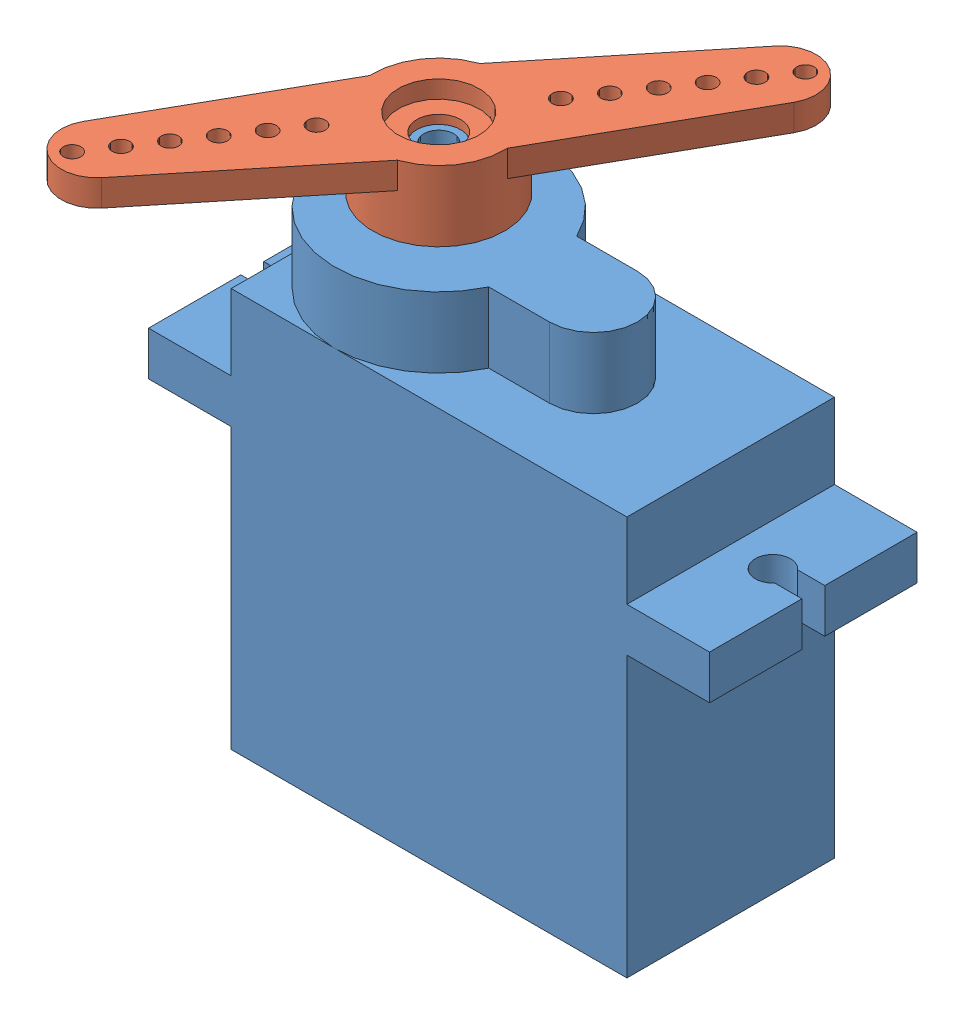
SolidWorks assembly SG60 Servo.SLDASM, configuration Default (file format 9000). Lengths in mm.
Overall size (33.42 31.4 30.66).
2 component instances, 2 part files, 2 mates.
Components (placement in the parent):
- Servo-1: Servo.SLDPRT [Default] at origin size (31.9 29.9 11.8)
- Horn Servo-1: Horn Servo.SLDPRT [Default] at (-5.35 16.05 0) x (-0.56383 0 0.825891) z (-0.825891 0 -0.56383) size (32 4 7.5)
Mates (geometry in assembly coordinates):
- Concentric1: concentric aligned: cylinder of Servo-1 through (-5.35 18.55 0) axis (0 -1 0) radius 2.3; cylinder of Horn Servo-1 through (-5.35 18.55 0) axis (0 -1 0) radius 2.3
- Coincident1: coincident anti-aligned: plane of Servo-1 through (-5.35 18.55 0) normal (0 1 0); plane of Horn Servo-1 through (-5.35 18.55 0) normal (0 -1 0)
